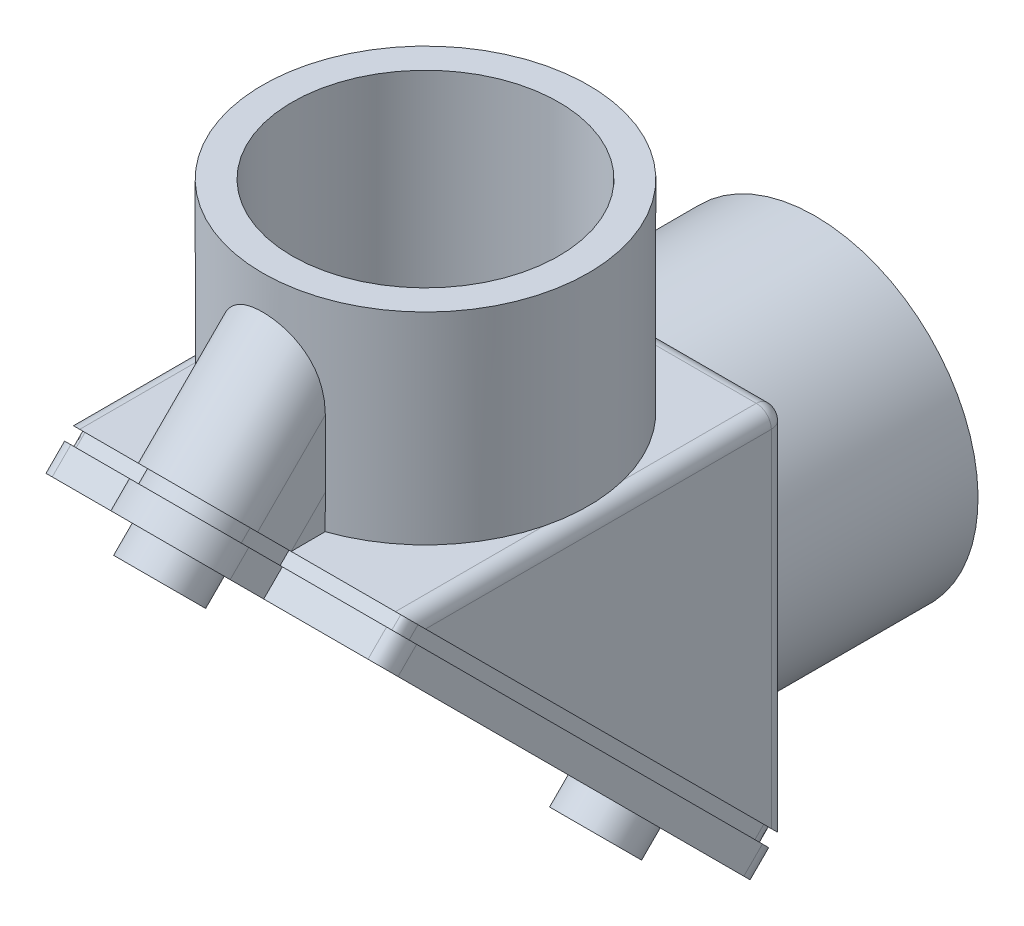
from build123d import *

# Parameters (mm, degrees)
EXTRUDE1_DEPTH                = 17.526
EXTRUDE1_DEPTH_BACK           = 17.526
FILLET1_R                     = 1.524
SHELL1_T                      = -3.81
COVERMTNGHUBS_EXTRUDE2_DEPTH  = 17.526
ODSOCKETBOSS_SKETCH2_R        = 16.51
EXTRUDE3_DEPTH                = 20.447
ODSOCKETBOSS_SKETCH4_R        = 16.51
EXTRUDE4_DEPTH                = 20.447
SKETCH6_R                     = 13.5128
SOCKET_CUT_EXTRUDE1_DEPTH     = 19.8374
SKETCH7_R                     = 13.5128
SOCKET_CUT_EXTRUDE2_DEPTH     = 19.8374
SKETCH8_R                     = 10.795
SOCKETTHRU_CUT_EXTRUDE3_DEPTH = 64.078716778
SKETCH9_R                     = 10.795
SOCKETTHRU_CUT_EXTRUDE4_DEPTH = 64.078716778
EXTRUDE5_DEPTH                = 1.27
EXTRUDE6_START                = 2.667
EXTRUDE6_DEPTH                = 2.667
SKETCH12_R                    = 3.81
EXTRUDE7_DEPTH                = 2.667


with BuildPart() as part:
    # Sketch1 → Extrude1 (new, two sides: drawn at the far end of the back side and taken through both)
    with BuildSketch(Plane(origin=(0, 0, 0), x_dir=(0, 0, -1), z_dir=(1, 0, 0)).offset(-EXTRUDE1_DEPTH_BACK)):
        Polygon((0, 19.05), (-19.05, 19.05), (19.05, -19.05), (19.05, 0), (19.05, 19.05), align=None)
    extrude(amount=EXTRUDE1_DEPTH + EXTRUDE1_DEPTH_BACK)

    # Fillet1
    fillet1_edges = [part.edges().sort_by_distance(p)[0] for p in [
        (-17.526, 0, -19.05),
        (-17.526, 19.05, 0),
        (17.526, 0, -19.05),
        (17.526, 19.05, 0),
        (0, 19.05, -19.05),
    ]]
    fillet(fillet1_edges, radius=FILLET1_R)

    # Shell1
    shell1_openings = [part.faces().sort_by_distance(p)[0] for p in [
        (0, 0, 0),
    ]]
    offset(amount=SHELL1_T, openings=shell1_openings, kind=Kind.INTERSECTION)

    # Sketch5 → CoverMtngHubs-Extrude2 (add)
    with BuildSketch(Plane(origin=(0, 0, 0), x_dir=(1, 0, 0), z_dir=(0, -0.7071067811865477, 0.7071067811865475))):
        with BuildLine():
            Line((-5.4356, 31.75), (-5.4356, 26.940768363))
            Line((-5.4356, 26.940768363), (-5.4356, 22.712927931))
            Line((-5.4356, 22.712927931), (5.41587582, 22.712927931))
            Line((5.41587582, 22.712927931), (5.4356, 26.940768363))
            Line((5.4356, 26.940768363), (5.4356, 31.75))
            ThreePointArc((5.4356, 31.75), (0, 37.1856), (-5.4356, 31.75))
        make_face()
        with BuildLine():
            Line((5.4356, -31.75), (5.4356, -26.940768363))
            Line((5.4356, -26.940768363), (5.41587582, -22.712927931))
            Line((5.41587582, -22.712927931), (-5.4356, -22.712927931))
            Line((-5.4356, -22.712927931), (-5.4356, -26.940768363))
            Line((-5.4356, -26.940768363), (-5.4356, -31.75))
            ThreePointArc((-5.4356, -31.75), (0, -37.1856), (5.4356, -31.75))
        make_face()
    extrude(amount=-COVERMTNGHUBS_EXTRUDE2_DEPTH)

    # ODsocketboss-Sketch2 → Extrude3 (add)
    with BuildSketch(Plane(origin=(0, 19.05, 0), x_dir=(-1, 0, 0), z_dir=(0, 1, 0))):
        with Locations(Location((0, 0, 0), (0, 0, 345.749967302))):
            Circle(ODSOCKETBOSS_SKETCH2_R)
    extrude(amount=EXTRUDE3_DEPTH)

    # ODsocketboss-Sketch4 → Extrude4 (add)
    with BuildSketch(Plane(origin=(0, 0, -19.05), x_dir=(-1, 0, 0), z_dir=(0, 0, -1))):
        with Locations(Location((0, 0, 0), (0, 0, 250.819808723))):
            Circle(ODSOCKETBOSS_SKETCH4_R)
    extrude(amount=EXTRUDE4_DEPTH)

    # Sketch6 → Socket--Cut-Extrude1 (cut)
    with BuildSketch(Plane(origin=(0, 0, -39.497), x_dir=(-1, 0, 0), z_dir=(0, 0, -1))):
        with Locations(Location((0, 0, 0), (0, 0, 90))):
            Circle(SKETCH6_R)
    extrude(amount=-SOCKET_CUT_EXTRUDE1_DEPTH, mode=Mode.SUBTRACT)

    # Sketch7 → Socket--Cut-Extrude2 (cut)
    with BuildSketch(Plane(origin=(0, 39.497, 0), x_dir=(-1, 0, 0), z_dir=(0, 1, 0))):
        with Locations(Location((0, 0, 0), (0, 0, 90))):
            Circle(SKETCH7_R)
    extrude(amount=-SOCKET_CUT_EXTRUDE2_DEPTH, mode=Mode.SUBTRACT)

    # Sketch8 → SocketTHRU-Cut-Extrude3 (cut, through all)
    with BuildSketch(Plane(origin=(0, 0, -19.6596), x_dir=(-1, 0, 0), z_dir=(0, 0, -1))):
        with Locations(Location((0, 0, 0), (0, 0, 90))):
            Circle(SKETCH8_R)
    extrude(amount=-SOCKETTHRU_CUT_EXTRUDE3_DEPTH, mode=Mode.SUBTRACT)

    # Sketch9 → SocketTHRU-Cut-Extrude4 (cut, through all)
    with BuildSketch(Plane(origin=(0, 19.6596, 0), x_dir=(-1, 0, 0), z_dir=(0, 1, 0))):
        with Locations(Location((0, 0, 0), (0, 0, 90))):
            Circle(SKETCH9_R)
    extrude(amount=-SOCKETTHRU_CUT_EXTRUDE4_DEPTH, mode=Mode.SUBTRACT)

    # Sketch10 → Extrude5 (add)
    with BuildSketch(Plane(origin=(0, 0, 0), x_dir=(1, 0, 0), z_dir=(0, -0.7071067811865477, 0.7071067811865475))):
        with BuildLine():
            Line((-4.6736, 31.75), (-4.6736, 26.178768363))
            Line((-4.6736, 26.178768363), (-16.002, 26.178768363))
            add(Edge.make_bspline(
                [(-16.002, 26.178768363), (-16.074874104, 26.178768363), (-16.144329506, 26.152769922), (-16.267023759, 26.078983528), (-16.321851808, 26.030722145), (-16.466647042, 25.873249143), (-16.540927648, 25.747914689), (-16.65540061, 25.488073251), (-16.696734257, 25.349541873), (-16.750804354, 25.07034225), (-16.764, 24.928834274), (-16.764, 24.785506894)],
                knots=[0, 0, 0, 0, 0.125, 0.125, 0.25, 0.25, 0.5, 0.5, 0.75, 0.75, 1, 1, 1, 1], degree=3))
            Line((-16.764, 24.785506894), (-16.764, -24.785506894))
            add(Edge.make_bspline(
                [(-16.764, -24.785506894), (-16.764, -24.928904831), (-16.750787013, -25.070024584), (-16.697192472, -25.347579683), (-16.656344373, -25.485586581), (-16.541283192, -25.747448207), (-16.467043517, -25.872703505), (-16.322186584, -26.030414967), (-16.26747506, -26.07865822), (-16.144508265, -26.152716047), (-16.074734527, -26.178768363), (-16.002, -26.178768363)],
                knots=[0, 0, 0, 0, 0.25, 0.25, 0.5, 0.5, 0.75, 0.75, 0.875, 0.875, 1, 1, 1, 1], degree=3))
            Line((-16.002, -26.178768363), (-4.6736, -26.178768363))
            Line((-4.6736, -26.178768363), (-4.6736, -31.75))
            ThreePointArc((-4.6736, -31.75), (0, -36.4236), (4.6736, -31.75))
            Line((4.6736, -31.75), (4.6736, -26.178768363))
            Line((4.6736, -26.178768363), (16.002, -26.178768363))
            add(Edge.make_bspline(
                [(16.002, -26.178768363), (16.074874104, -26.178768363), (16.144329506, -26.152769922), (16.267023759, -26.078983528), (16.321851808, -26.030722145), (16.466647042, -25.873249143), (16.540927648, -25.747914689), (16.65540061, -25.488073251), (16.696734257, -25.349541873), (16.750804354, -25.07034225), (16.764, -24.928834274), (16.764, -24.785506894)],
                knots=[0, 0, 0, 0, 0.125, 0.125, 0.25, 0.25, 0.5, 0.5, 0.75, 0.75, 1, 1, 1, 1], degree=3))
            Line((16.764, -24.785506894), (16.764, 24.785506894))
            add(Edge.make_bspline(
                [(16.764, 24.785506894), (16.764, 24.928904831), (16.750787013, 25.070024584), (16.697192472, 25.347579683), (16.656344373, 25.485586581), (16.541283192, 25.747448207), (16.467043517, 25.872703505), (16.322186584, 26.030414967), (16.26747506, 26.07865822), (16.144508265, 26.152716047), (16.074734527, 26.178768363), (16.002, 26.178768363)],
                knots=[0, 0, 0, 0, 0.25, 0.25, 0.5, 0.5, 0.75, 0.75, 0.875, 0.875, 1, 1, 1, 1], degree=3))
            Line((16.002, 26.178768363), (4.6736, 26.178768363))
            Line((4.6736, 26.178768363), (4.6736, 31.75))
            ThreePointArc((4.6736, 31.75), (0, 36.4236), (-4.6736, 31.75))
        make_face()
    extrude(amount=EXTRUDE5_DEPTH)

    # Sketch11 → Extrude6 (add)
    with BuildSketch(Plane(origin=(0, -0.898025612, 0.898025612), x_dir=(1, 0, 0), z_dir=(0, -0.7071067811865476, 0.7071067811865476)).offset(EXTRUDE6_START)):
        with BuildLine():
            Line((-5.4356, 31.75), (-5.4356, 26.940768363))
            Line((-5.4356, 26.940768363), (-16.002, 26.940768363))
            add(Edge.make_bspline(
                [(-16.002, 26.940768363), (-17.526, 26.940768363), (-17.526, 24.785506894)],
                knots=[3.141592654, 3.141592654, 3.141592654, 4.71238898, 4.71238898, 4.71238898], degree=2, weights=[1, 0.707106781, 1]))
            Line((-17.526, 24.785506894), (-17.526, -24.785506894))
            add(Edge.make_bspline(
                [(-17.526, -24.785506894), (-17.526, -26.940768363), (-16.002, -26.940768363)],
                knots=[4.71238898, 4.71238898, 4.71238898, 6.283185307, 6.283185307, 6.283185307], degree=2, weights=[1, 0.707106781, 1]))
            Line((-16.002, -26.940768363), (-5.4356, -26.940768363))
            Line((-5.4356, -26.940768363), (-5.4356, -31.75))
            ThreePointArc((-5.4356, -31.75), (0, -37.1856), (5.4356, -31.75))
            Line((5.4356, -31.75), (5.4356, -26.940768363))
            Line((5.4356, -26.940768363), (16.002, -26.940768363))
            add(Edge.make_bspline(
                [(16.002, -26.940768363), (17.526, -26.940768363), (17.526, -24.785506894)],
                knots=[3.141592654, 3.141592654, 3.141592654, 4.71238898, 4.71238898, 4.71238898], degree=2, weights=[1, 0.707106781, 1]))
            Line((17.526, -24.785506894), (17.526, 24.785506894))
            add(Edge.make_bspline(
                [(17.526, 24.785506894), (17.526, 26.940768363), (16.002, 26.940768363)],
                knots=[4.71238898, 4.71238898, 4.71238898, 6.283185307, 6.283185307, 6.283185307], degree=2, weights=[1, 0.707106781, 1]))
            Line((16.002, 26.940768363), (5.4356, 26.940768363))
            Line((5.4356, 26.940768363), (5.4356, 31.75))
            ThreePointArc((5.4356, 31.75), (0, 37.1856), (-5.4356, 31.75))
        make_face()
    extrude(amount=-EXTRUDE6_DEPTH)

    # Sketch12 → Extrude7 (add)
    with BuildSketch(Plane(origin=(0, -2.783879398, 2.783879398), x_dir=(1, 0, 0), z_dir=(0, -0.7071067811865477, 0.7071067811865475))):
        with Locations(Location((0, -30.983715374, 0), (0, 0, 270))):
            Circle(SKETCH12_R)
        with Locations(Location((0, 31.505588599, 0), (0, 0, 270))):
            Circle(SKETCH12_R)
    extrude(amount=EXTRUDE7_DEPTH)


solid = part.part
